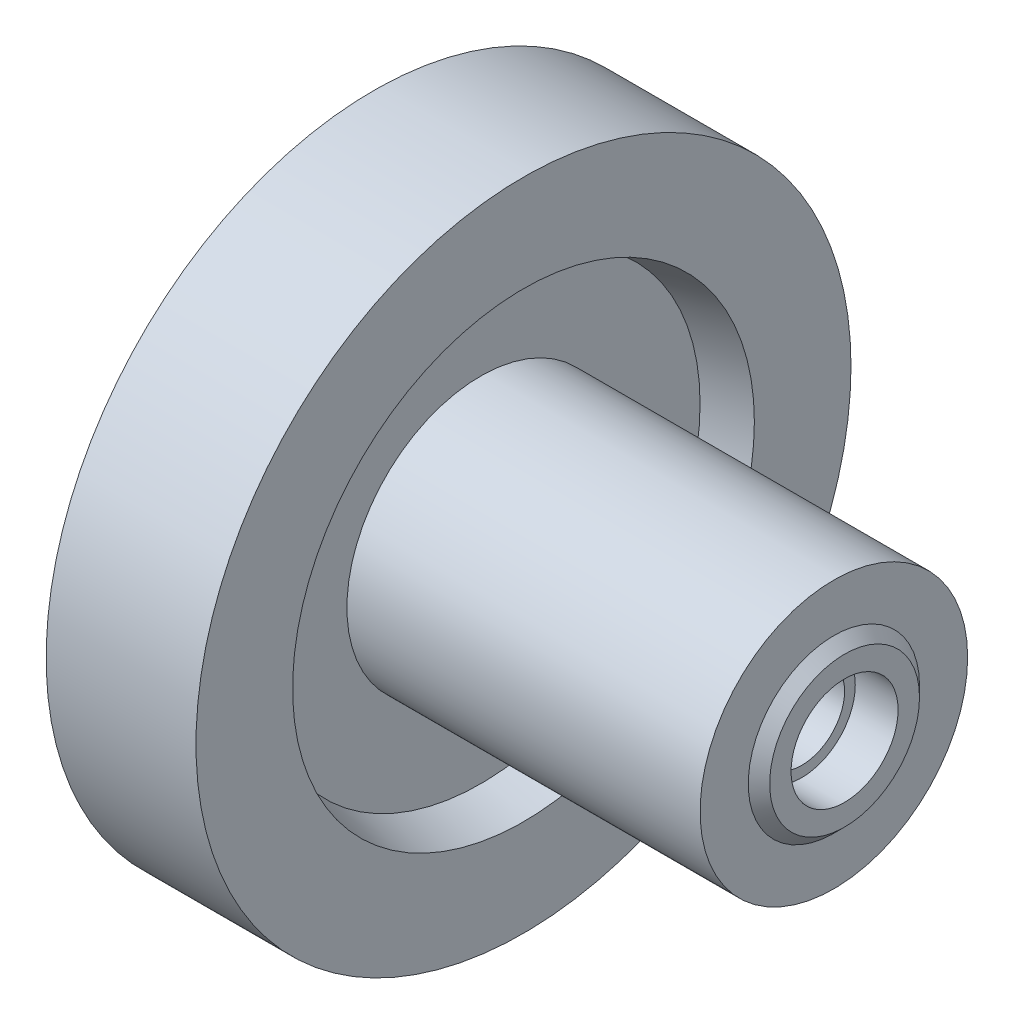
from build123d import *


with BuildPart() as part:
    # Esquisse1 → Base-R_volution (revolve)
    with BuildSketch(Plane.XY, mode=Mode.PRIVATE) as base_r_volution_sk:
        Polygon((-50.2, 2), (-70, 2), (-70, 3.38), (-68.199924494, 3.38), (-68.199924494, 10.25), (-70.199924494, 10.785898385), (-70.199924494, 15.3), (-63.199924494, 15.3), (-63.199924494, 10.785898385), (-65.199924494, 10.25), (-65.199924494, 6.25), (-48.699924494, 6.25), (-48.699924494, 3.999924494), (-48.2, 3.5), (-48.2, 2.5), (-50.2, 2.5), align=None)
    revolve(base_r_volution_sk.sketch.rotate(Axis((-19.668712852, 0, 0), (-1, 0, 0)), 90), axis=Axis((-19.668712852, 0, 0), (-1, 0, 0)))


solid = part.part
